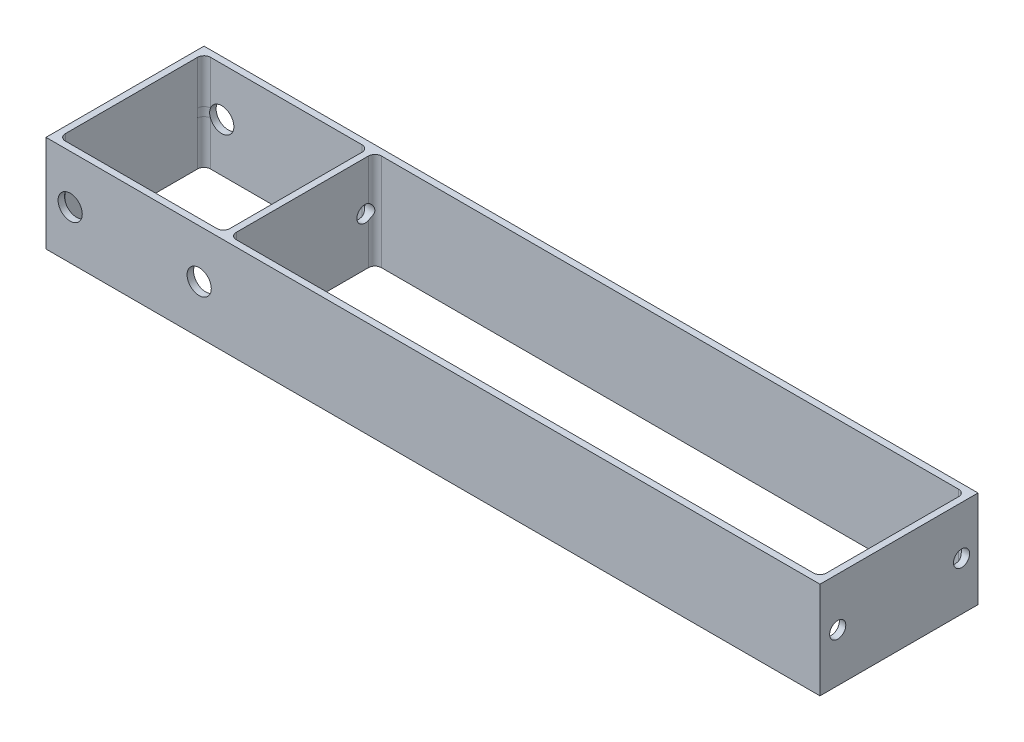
from build123d import *

# Parameters (mm, degrees)
SKETCH1_W          = 609.6
SKETCH1_H          = 76.2
EXTRUDE1_DEPTH     = 124.46
SKETCH4_W          = 129.54
SKETCH4_H          = 114.3
SKETCH4_W_2        = 464.82
CUT_EXTRUDE1_DEPTH = 562.518011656
SKETCH5_R          = 9.525
CUT_EXTRUDE2_DEPTH = 561.10984751
FILLET1_R          = 5.08
FILLET2_R          = 5.08
FILLET3_R          = 5.08
SKETCH6_R          = 6.35
CUT_EXTRUDE3_DEPTH = 508


with BuildPart() as part:
    # Sketch1 → Extrude1 (new body)
    with BuildSketch(Plane.XY):
        with Locations((237.422966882, 26.915412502)):
            Rectangle(SKETCH1_W, SKETCH1_H)
    extrude(amount=EXTRUDE1_DEPTH)

    # Sketch4 → Cut-Extrude1 (cut, through all)
    with BuildSketch(Plane(origin=(0, 65.015412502, 0), x_dir=(-1, 0, 0), z_dir=(0, 1, 0))):
        with Locations((-2.472966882, 62.23)):
            Rectangle(SKETCH4_W, SKETCH4_H)
        with Locations((-304.732966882, 62.23)):
            Rectangle(SKETCH4_W_2, SKETCH4_H)
    extrude(amount=-CUT_EXTRUDE1_DEPTH, mode=Mode.SUBTRACT)

    # Sketch5 → Cut-Extrude2 (cut, through all)
    with BuildSketch(Plane.XY.offset(124.46)):
        with Locations((-48.327033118, 26.915412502)):
            Circle(SKETCH5_R)
        with Locations((53.272966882, 26.915412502)):
            Circle(SKETCH5_R)
    extrude(amount=-CUT_EXTRUDE2_DEPTH, mode=Mode.SUBTRACT)

    # Fillet1
    fillet1_edges = [part.edges().sort_by_distance(p)[0] for p in [
        (537.142966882, 26.915412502, 119.38),
        (72.322966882, 26.915412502, 5.08),
        (537.142966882, 26.915412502, 5.08),
        (67.242966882, 26.915412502, 5.08),
        (67.242966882, 26.915412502, 119.38),
        (-62.297033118, 26.915412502, 5.08),
    ]]
    fillet(fillet1_edges, radius=FILLET1_R)

    # Fillet2
    fillet2_edges = [part.edges().sort_by_distance(p)[0] for p in [
        (72.322966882, 26.915412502, 119.38),
    ]]
    fillet(fillet2_edges, radius=FILLET2_R)

    # Fillet3
    fillet3_edges = [part.edges().sort_by_distance(p)[0] for p in [
        (-62.297033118, 26.915412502, 119.38),
    ]]
    fillet(fillet3_edges, radius=FILLET3_R)

    # Sketch6 → Cut-Extrude3 (cut)
    with BuildSketch(Plane(origin=(542.222966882, 0, 0), x_dir=(0, 0, -1), z_dir=(1, 0, 0))):
        with Locations(Location((-110.49, 26.915412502, 0), (0, 0, 233.130102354))):
            Circle(SKETCH6_R)
        with Locations(Location((-12.954, 26.915412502, 0), (0, 0, 63.896118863))):
            Circle(SKETCH6_R)
    extrude(amount=-CUT_EXTRUDE3_DEPTH, mode=Mode.SUBTRACT)


solid = part.part
